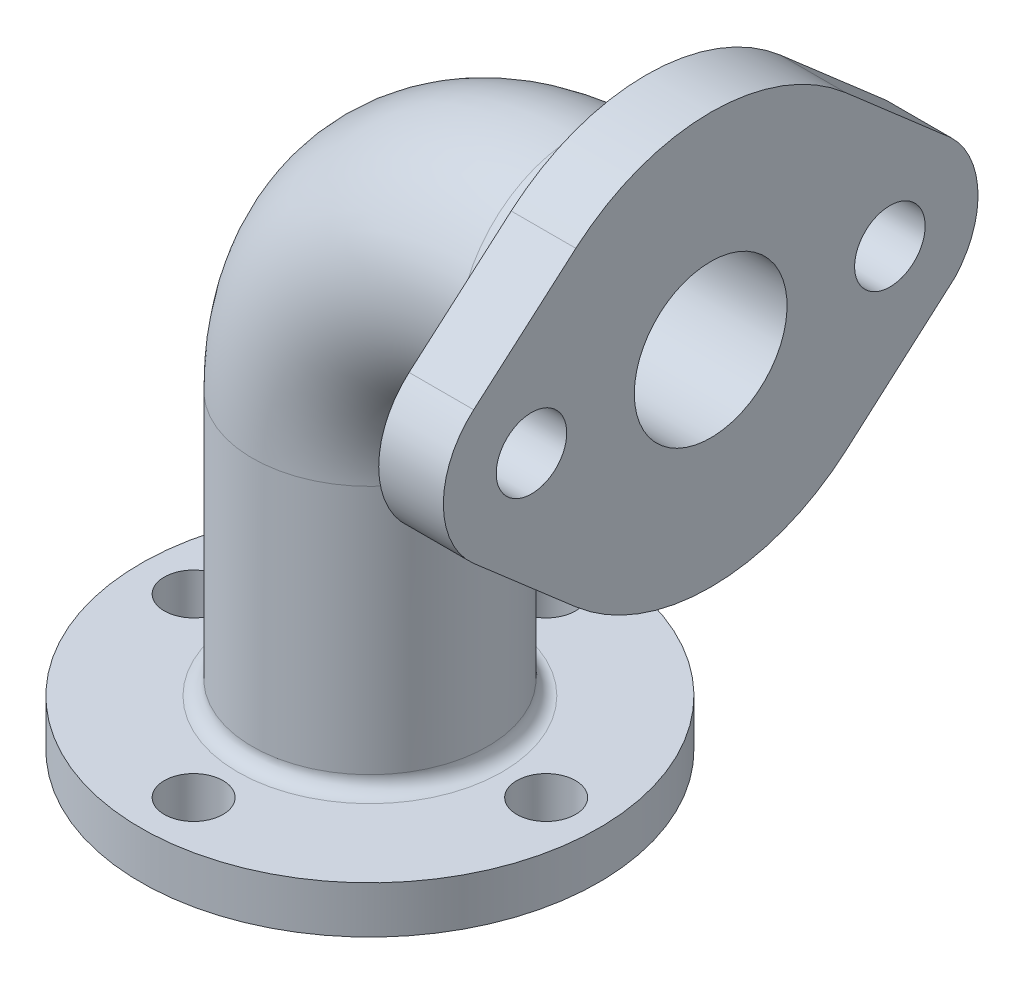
from build123d import *

# Parameters (mm, degrees)
BARRER_L_MINA1_PROFILE_R   = 20
BARRER_L_MINA1_PROFILE_R_2 = 13
CROQUIS166_R               = 6
CROQUIS166_R_2             = 20
SALIENTE_EXTRUIR2_DEPTH    = 11
SALIENTE_EXTRUIR3_START    = -8
CROQUIS167_R               = 39
CROQUIS167_R_2             = 13
SALIENTE_EXTRUIR3_DEPTH    = 8
CROQUIS168_R               = 5
CORTAR_EXTRUIR2_DEPTH      = 15
REDONDEO1_R                = 2.5
REDONDEO2_R                = 2.5


with BuildPart() as part:
    # Barrer-L_mina1: sweep along a path in Croquis8
    with BuildLine(Plane.XY) as barrer_l_mina1_path:
        Line((0, 0), (0, 53))
        ThreePointArc((0, 53), (10.251262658, 77.748737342), (35, 88))
        Line((35, 88), (58, 88))
    # Barrer-L_mina1 profile (on start of the path) → Barrer-L_mina1 (sweep)
    with BuildSketch(Plane.ZX):
        Circle(BARRER_L_MINA1_PROFILE_R)
        Circle(BARRER_L_MINA1_PROFILE_R_2, mode=Mode.SUBTRACT)
    sweep(path=barrer_l_mina1_path.line)

    # Croquis166 → Saliente-Extruir2 (add)
    with BuildSketch(Plane(origin=(58, 0, 0), x_dir=(0, 0, -1), z_dir=(1, 0, 0))):
        with BuildLine():
            Line((-40.336065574, 99.324831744), (-22.950819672, 114.424607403))
            ThreePointArc((-22.950819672, 114.424607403), (0.012124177, 122.9999979), (22.969121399, 114.408700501))
            Line((22.969121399, 114.408700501), (40.855221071, 98.852160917))
            ThreePointArc((40.855221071, 98.852160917), (45.491803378, 88.495813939), (41.549621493, 77.8557472))
            Line((41.549621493, 77.8557472), (23.053076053, 61.664554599))
            ThreePointArc((23.053076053, 61.664554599), (0.067834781, 53.000065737), (-22.950819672, 61.575392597))
            Line((-22.950819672, 61.575392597), (-40.336065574, 76.675168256))
            ThreePointArc((-40.336065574, 76.675168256), (-45.5, 88), (-40.336065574, 99.324831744))
        make_face()
        with Locations((-30.5, 88)):
            Circle(CROQUIS166_R, mode=Mode.SUBTRACT)
        with Locations((30.5, 88)):
            Circle(CROQUIS166_R, mode=Mode.SUBTRACT)
        with Locations((0, 88)):
            Circle(CROQUIS166_R_2, mode=Mode.SUBTRACT)
    extrude(amount=-SALIENTE_EXTRUIR2_DEPTH)

    # Croquis167 → Saliente-Extruir3 (add)
    with BuildSketch(Plane.XZ.offset(SALIENTE_EXTRUIR3_START)):
        with Locations(Location((0, 0, 0), (0, 0, 270))):
            Circle(CROQUIS167_R)
        with Locations(Location((0, 0, 0), (0, 0, 180))):
            Circle(CROQUIS167_R_2, mode=Mode.SUBTRACT)
    extrude(amount=SALIENTE_EXTRUIR3_DEPTH)

    # Croquis168 → Cortar-Extruir2 (cut)
    with BuildSketch(Plane.XZ):
        with Locations(Location((0, 30, 0), (0, 0, 270))):
            Circle(CROQUIS168_R)
        with Locations(Location((0, -30, 0), (0, 0, 270))):
            Circle(CROQUIS168_R)
        with Locations(Location((30, 0, 0), (0, 0, 270))):
            Circle(CROQUIS168_R)
        with Locations(Location((-30, 0, 0), (0, 0, 270))):
            Circle(CROQUIS168_R)
    extrude(amount=-CORTAR_EXTRUIR2_DEPTH, mode=Mode.SUBTRACT)

    # Redondeo1
    redondeo1_edges = [part.edges().sort_by_distance(p)[0] for p in [
        (47, 88, -20),
    ]]
    fillet(redondeo1_edges, radius=REDONDEO1_R)

    # Redondeo2
    redondeo2_edges = [part.edges().sort_by_distance(p)[0] for p in [
        (0, 8, -20),
    ]]
    fillet(redondeo2_edges, radius=REDONDEO2_R)


solid = part.part
